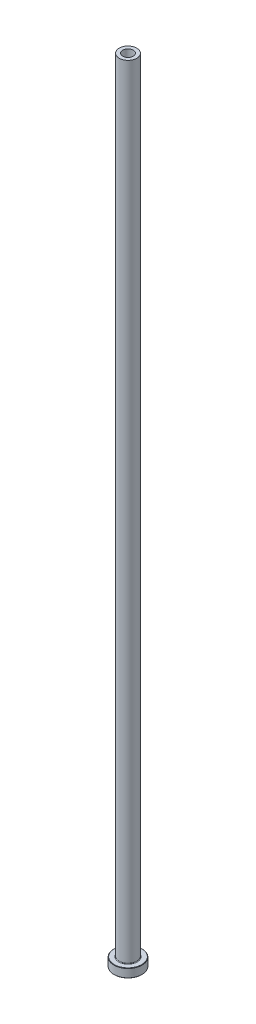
ISO-10303-21;
HEADER;
FILE_DESCRIPTION(('STEP AP214'),'2;1');
FILE_NAME('part.step','',(''),(''),'','','');
FILE_SCHEMA(('AUTOMOTIVE_DESIGN { 1 0 10303 214 1 1 1 1 }'));
ENDSEC;
DATA;
#1=APPLICATION_CONTEXT('core data for automotive mechanical design processes');
#2=APPLICATION_PROTOCOL_DEFINITION('international standard','automotive_design',2000,#1);
#3=PRODUCT_CONTEXT('',#1,'mechanical');
#4=PRODUCT('Part','Part','',(#3));
#5=PRODUCT_RELATED_PRODUCT_CATEGORY('part','',(#4));
#6=PRODUCT_DEFINITION_FORMATION('','',#4);
#7=PRODUCT_DEFINITION_CONTEXT('part definition',#1,'design');
#8=PRODUCT_DEFINITION('design','',#6,#7);
#9=PRODUCT_DEFINITION_SHAPE('','',#8);
#10=(LENGTH_UNIT() NAMED_UNIT(*) SI_UNIT(.MILLI.,.METRE.));
#11=(NAMED_UNIT(*) PLANE_ANGLE_UNIT() SI_UNIT($,.RADIAN.));
#12=(NAMED_UNIT(*) SI_UNIT($,.STERADIAN.) SOLID_ANGLE_UNIT());
#13=UNCERTAINTY_MEASURE_WITH_UNIT(LENGTH_MEASURE(1.E-05),#10,'distance_accuracy_value','');
#14=(GEOMETRIC_REPRESENTATION_CONTEXT(3) GLOBAL_UNCERTAINTY_ASSIGNED_CONTEXT((#13)) GLOBAL_UNIT_ASSIGNED_CONTEXT((#10,
#11,#12)) REPRESENTATION_CONTEXT('',''));
#15=CARTESIAN_POINT('',(0.,0.,0.));
#16=DIRECTION('',(0.,0.,1.));
#17=DIRECTION('',(1.,0.,0.));
#18=AXIS2_PLACEMENT_3D('',#15,#16,#17);
#19=CARTESIAN_POINT('',(0.,92.1876809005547,0.));
#20=DIRECTION('',(0.,1.,0.));
#21=DIRECTION('',(0.,0.,1.));
#22=AXIS2_PLACEMENT_3D('',#19,#20,#21);
#23=CYLINDRICAL_SURFACE('',#22,3.00000000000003);
#24=CARTESIAN_POINT('',(0.,450.,0.));
#25=DIRECTION('',(0.,1.,0.));
#26=DIRECTION('',(0.,0.,1.));
#27=AXIS2_PLACEMENT_3D('',#24,#25,#26);
#28=CIRCLE('',#27,3.00000000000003);
#29=CARTESIAN_POINT('',(0.,450.,3.00000000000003));
#30=VERTEX_POINT('',#29);
#31=EDGE_CURVE('E62',#30,#30,#28,.T.);
#32=ORIENTED_EDGE('',*,*,#31,.T.);
#33=EDGE_LOOP('',(#32));
#34=FACE_BOUND('',#33,.T.);
#35=CARTESIAN_POINT('',(0.,405.,0.));
#36=DIRECTION('',(0.,1.,0.));
#37=DIRECTION('',(0.,0.,1.));
#38=AXIS2_PLACEMENT_3D('',#35,#36,#37);
#39=CIRCLE('',#38,3.00000000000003);
#40=CARTESIAN_POINT('',(0.,405.,3.00000000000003));
#41=VERTEX_POINT('',#40);
#42=EDGE_CURVE('E71',#41,#41,#39,.T.);
#43=ORIENTED_EDGE('',*,*,#42,.F.);
#44=EDGE_LOOP('',(#43));
#45=FACE_BOUND('',#44,.T.);
#46=ADVANCED_FACE('F30',(#34,#45),#23,.F.);
#47=CARTESIAN_POINT('',(-3.00000000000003,450.,0.));
#48=DIRECTION('',(0.,1.,0.));
#49=DIRECTION('',(0.,0.,1.));
#50=AXIS2_PLACEMENT_3D('',#47,#48,#49);
#51=PLANE('',#50);
#52=CARTESIAN_POINT('',(0.,450.,0.));
#53=DIRECTION('',(0.,1.,0.));
#54=DIRECTION('',(0.,0.,1.));
#55=AXIS2_PLACEMENT_3D('',#52,#53,#54);
#56=CIRCLE('',#55,5.00000000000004);
#57=CARTESIAN_POINT('',(0.,450.,5.00000000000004));
#58=VERTEX_POINT('',#57);
#59=EDGE_CURVE('E65',#58,#58,#56,.T.);
#60=ORIENTED_EDGE('',*,*,#59,.T.);
#61=EDGE_LOOP('',(#60));
#62=FACE_BOUND('',#61,.T.);
#63=ORIENTED_EDGE('',*,*,#31,.F.);
#64=EDGE_LOOP('',(#63));
#65=FACE_BOUND('',#64,.T.);
#66=ADVANCED_FACE('F79',(#62,#65),#51,.T.);
#67=CARTESIAN_POINT('',(0.,92.1876809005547,0.));
#68=DIRECTION('',(0.,1.,0.));
#69=DIRECTION('',(0.,0.,1.));
#70=AXIS2_PLACEMENT_3D('',#67,#68,#69);
#71=CYLINDRICAL_SURFACE('',#70,5.00000000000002);
#72=CARTESIAN_POINT('',(0.,5.3,0.));
#73=DIRECTION('',(0.,1.,0.));
#74=DIRECTION('',(0.,0.,1.));
#75=AXIS2_PLACEMENT_3D('',#72,#73,#74);
#76=CIRCLE('',#75,5.00000000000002);
#77=CARTESIAN_POINT('',(0.,5.3,5.00000000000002));
#78=VERTEX_POINT('',#77);
#79=EDGE_CURVE('E59',#78,#78,#76,.T.);
#80=ORIENTED_EDGE('',*,*,#79,.T.);
#81=EDGE_LOOP('',(#80));
#82=FACE_BOUND('',#81,.T.);
#83=ORIENTED_EDGE('',*,*,#59,.F.);
#84=EDGE_LOOP('',(#83));
#85=FACE_BOUND('',#84,.T.);
#86=ADVANCED_FACE('F85',(#82,#85),#71,.T.);
#87=CARTESIAN_POINT('',(-4.99999999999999,5.,0.));
#88=DIRECTION('',(0.,1.,0.));
#89=DIRECTION('',(0.,0.,1.));
#90=AXIS2_PLACEMENT_3D('',#87,#88,#89);
#91=PLANE('',#90);
#92=CARTESIAN_POINT('',(0.,5.,0.));
#93=DIRECTION('',(0.,1.,0.));
#94=DIRECTION('',(0.,0.,1.));
#95=AXIS2_PLACEMENT_3D('',#92,#93,#94);
#96=CIRCLE('',#95,7.80000000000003);
#97=CARTESIAN_POINT('',(0.,5.,7.80000000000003));
#98=VERTEX_POINT('',#97);
#99=EDGE_CURVE('E53',#98,#98,#96,.T.);
#100=ORIENTED_EDGE('',*,*,#99,.T.);
#101=EDGE_LOOP('',(#100));
#102=FACE_BOUND('',#101,.T.);
#103=CARTESIAN_POINT('',(0.,5.,0.));
#104=DIRECTION('',(0.,1.,0.));
#105=DIRECTION('',(0.,0.,1.));
#106=AXIS2_PLACEMENT_3D('',#103,#104,#105);
#107=CIRCLE('',#106,5.30000000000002);
#108=CARTESIAN_POINT('',(0.,5.,5.30000000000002));
#109=VERTEX_POINT('',#108);
#110=EDGE_CURVE('E56',#109,#109,#107,.F.);
#111=ORIENTED_EDGE('',*,*,#110,.T.);
#112=EDGE_LOOP('',(#111));
#113=FACE_BOUND('',#112,.T.);
#114=ADVANCED_FACE('F111',(#102,#113),#91,.T.);
#115=CARTESIAN_POINT('',(0.,92.1876809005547,0.));
#116=DIRECTION('',(0.,1.,0.));
#117=DIRECTION('',(0.,0.,1.));
#118=AXIS2_PLACEMENT_3D('',#115,#116,#117);
#119=CYLINDRICAL_SURFACE('',#118,7.99999999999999);
#120=CARTESIAN_POINT('',(0.,4.80000000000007,0.));
#121=DIRECTION('',(0.,1.,0.));
#122=DIRECTION('',(0.,0.,1.));
#123=AXIS2_PLACEMENT_3D('',#120,#121,#122);
#124=CIRCLE('',#123,7.99999999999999);
#125=CARTESIAN_POINT('',(0.,4.80000000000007,7.99999999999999));
#126=VERTEX_POINT('',#125);
#127=EDGE_CURVE('E45',#126,#126,#124,.F.);
#128=ORIENTED_EDGE('',*,*,#127,.T.);
#129=EDGE_LOOP('',(#128));
#130=FACE_BOUND('',#129,.T.);
#131=CARTESIAN_POINT('',(0.,0.200000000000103,0.));
#132=DIRECTION('',(0.,-1.,0.));
#133=DIRECTION('',(0.,0.,-1.));
#134=AXIS2_PLACEMENT_3D('',#131,#132,#133);
#135=CIRCLE('',#134,7.99999999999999);
#136=CARTESIAN_POINT('',(0.,0.200000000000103,-7.99999999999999));
#137=VERTEX_POINT('',#136);
#138=EDGE_CURVE('E50',#137,#137,#135,.F.);
#139=ORIENTED_EDGE('',*,*,#138,.T.);
#140=EDGE_LOOP('',(#139));
#141=FACE_BOUND('',#140,.T.);
#142=ADVANCED_FACE('F108',(#130,#141),#119,.T.);
#143=CARTESIAN_POINT('',(-7.99999999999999,0.,0.));
#144=DIRECTION('',(0.,-1.,0.));
#145=DIRECTION('',(0.,0.,-1.));
#146=AXIS2_PLACEMENT_3D('',#143,#144,#145);
#147=PLANE('',#146);
#148=CARTESIAN_POINT('',(0.,0.,0.));
#149=DIRECTION('',(0.,-1.,0.));
#150=DIRECTION('',(0.,0.,-1.));
#151=AXIS2_PLACEMENT_3D('',#148,#149,#150);
#152=CIRCLE('',#151,3.74999999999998);
#153=CARTESIAN_POINT('',(0.,0.,-3.74999999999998));
#154=VERTEX_POINT('',#153);
#155=EDGE_CURVE('E37',#154,#154,#152,.F.);
#156=ORIENTED_EDGE('',*,*,#155,.T.);
#157=EDGE_LOOP('',(#156));
#158=FACE_BOUND('',#157,.T.);
#159=CARTESIAN_POINT('',(0.,0.,0.));
#160=DIRECTION('',(0.,-1.,0.));
#161=DIRECTION('',(0.,0.,-1.));
#162=AXIS2_PLACEMENT_3D('',#159,#160,#161);
#163=CIRCLE('',#162,7.79999999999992);
#164=CARTESIAN_POINT('',(0.,0.,-7.79999999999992));
#165=VERTEX_POINT('',#164);
#166=EDGE_CURVE('E41',#165,#165,#163,.T.);
#167=ORIENTED_EDGE('',*,*,#166,.T.);
#168=EDGE_LOOP('',(#167));
#169=FACE_BOUND('',#168,.T.);
#170=ADVANCED_FACE('F110',(#158,#169),#147,.T.);
#171=CARTESIAN_POINT('',(0.,92.1876809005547,0.));
#172=DIRECTION('',(0.,1.,0.));
#173=DIRECTION('',(0.,0.,1.));
#174=AXIS2_PLACEMENT_3D('',#171,#172,#173);
#175=CYLINDRICAL_SURFACE('',#174,3.25000000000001);
#176=CARTESIAN_POINT('',(0.,0.5,0.));
#177=DIRECTION('',(0.,-1.,0.));
#178=DIRECTION('',(0.,0.,-1.));
#179=AXIS2_PLACEMENT_3D('',#176,#177,#178);
#180=CIRCLE('',#179,3.25000000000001);
#181=CARTESIAN_POINT('',(0.,0.5,-3.25000000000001));
#182=VERTEX_POINT('',#181);
#183=EDGE_CURVE('E10',#182,#182,#180,.T.);
#184=ORIENTED_EDGE('',*,*,#183,.T.);
#185=EDGE_LOOP('',(#184));
#186=FACE_BOUND('',#185,.T.);
#187=CARTESIAN_POINT('',(0.,393.,0.));
#188=DIRECTION('',(0.,1.,0.));
#189=DIRECTION('',(0.,0.,1.));
#190=AXIS2_PLACEMENT_3D('',#187,#188,#189);
#191=CIRCLE('',#190,3.25000000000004);
#192=CARTESIAN_POINT('',(0.,393.,3.25000000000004));
#193=VERTEX_POINT('',#192);
#194=EDGE_CURVE('E68',#193,#193,#191,.T.);
#195=ORIENTED_EDGE('',*,*,#194,.T.);
#196=EDGE_LOOP('',(#195));
#197=FACE_BOUND('',#196,.T.);
#198=ADVANCED_FACE('F118',(#186,#197),#175,.F.);
#199=CARTESIAN_POINT('',(0.,393.,0.));
#200=DIRECTION('',(0.,-1.,0.));
#201=DIRECTION('',(0.,0.,-1.));
#202=AXIS2_PLACEMENT_3D('',#199,#200,#201);
#203=CONICAL_SURFACE('',#202,3.25000000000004,0.0208303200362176);
#204=ORIENTED_EDGE('',*,*,#42,.T.);
#205=EDGE_LOOP('',(#204));
#206=FACE_BOUND('',#205,.T.);
#207=ORIENTED_EDGE('',*,*,#194,.F.);
#208=EDGE_LOOP('',(#207));
#209=FACE_BOUND('',#208,.T.);
#210=ADVANCED_FACE('F75',(#206,#209),#203,.F.);
#211=CARTESIAN_POINT('',(0.,5.3,0.));
#212=DIRECTION('',(0.,1.,0.));
#213=DIRECTION('',(0.,0.,1.));
#214=AXIS2_PLACEMENT_3D('',#211,#212,#213);
#215=TOROIDAL_SURFACE('',#214,5.30000000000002,0.3);
#216=ORIENTED_EDGE('',*,*,#110,.F.);
#217=EDGE_LOOP('',(#216));
#218=FACE_BOUND('',#217,.T.);
#219=ORIENTED_EDGE('',*,*,#79,.F.);
#220=EDGE_LOOP('',(#219));
#221=FACE_BOUND('',#220,.T.);
#222=ADVANCED_FACE('F90',(#218,#221),#215,.F.);
#223=CARTESIAN_POINT('',(0.,5.,0.));
#224=DIRECTION('',(0.,-1.,0.));
#225=DIRECTION('',(0.,0.,-1.));
#226=AXIS2_PLACEMENT_3D('',#223,#224,#225);
#227=CONICAL_SURFACE('',#226,7.80000000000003,0.785398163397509);
#228=ORIENTED_EDGE('',*,*,#127,.F.);
#229=EDGE_LOOP('',(#228));
#230=FACE_BOUND('',#229,.T.);
#231=ORIENTED_EDGE('',*,*,#99,.F.);
#232=EDGE_LOOP('',(#231));
#233=FACE_BOUND('',#232,.T.);
#234=ADVANCED_FACE('F93',(#230,#233),#227,.T.);
#235=CARTESIAN_POINT('',(0.,0.200000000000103,0.));
#236=DIRECTION('',(0.,1.,0.));
#237=DIRECTION('',(0.,0.,1.));
#238=AXIS2_PLACEMENT_3D('',#235,#236,#237);
#239=CONICAL_SURFACE('',#238,7.99999999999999,0.78539816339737);
#240=ORIENTED_EDGE('',*,*,#166,.F.);
#241=EDGE_LOOP('',(#240));
#242=FACE_BOUND('',#241,.T.);
#243=ORIENTED_EDGE('',*,*,#138,.F.);
#244=EDGE_LOOP('',(#243));
#245=FACE_BOUND('',#244,.T.);
#246=ADVANCED_FACE('F96',(#242,#245),#239,.T.);
#247=CARTESIAN_POINT('',(0.,0.,0.));
#248=DIRECTION('',(0.,-1.,0.));
#249=DIRECTION('',(0.,0.,-1.));
#250=AXIS2_PLACEMENT_3D('',#247,#248,#249);
#251=CONICAL_SURFACE('',#250,3.74999999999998,0.78539816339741);
#252=ORIENTED_EDGE('',*,*,#183,.F.);
#253=EDGE_LOOP('',(#252));
#254=FACE_BOUND('',#253,.T.);
#255=ORIENTED_EDGE('',*,*,#155,.F.);
#256=EDGE_LOOP('',(#255));
#257=FACE_BOUND('',#256,.T.);
#258=ADVANCED_FACE('F32',(#254,#257),#251,.F.);
#259=CLOSED_SHELL('',(#46,#66,#86,#114,#142,#170,#198,#210,#222,#234,#246,#258));
#260=MANIFOLD_SOLID_BREP('B2',#259);
#261=ADVANCED_BREP_SHAPE_REPRESENTATION('',(#18,#260),#14);
#262=SHAPE_DEFINITION_REPRESENTATION(#9,#261);
ENDSEC;
END-ISO-10303-21;
